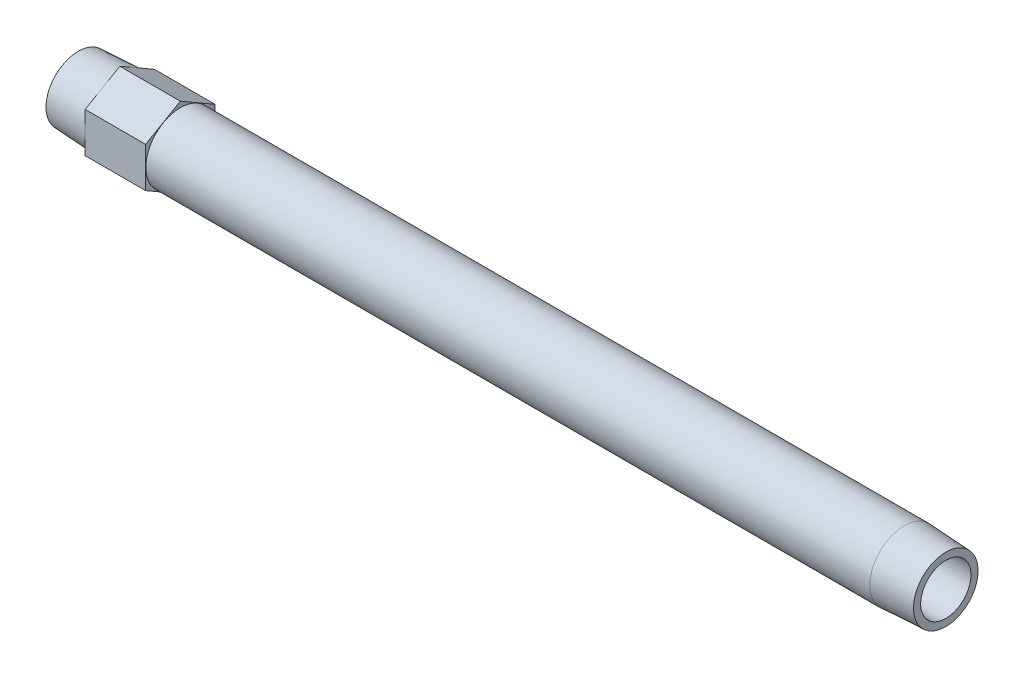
ISO-10303-21;
HEADER;
FILE_DESCRIPTION(('STEP AP214'),'2;1');
FILE_NAME('part.step','',(''),(''),'','','');
FILE_SCHEMA(('AUTOMOTIVE_DESIGN { 1 0 10303 214 1 1 1 1 }'));
ENDSEC;
DATA;
#1=APPLICATION_CONTEXT('core data for automotive mechanical design processes');
#2=APPLICATION_PROTOCOL_DEFINITION('international standard','automotive_design',2000,#1);
#3=PRODUCT_CONTEXT('',#1,'mechanical');
#4=PRODUCT('Part','Part','',(#3));
#5=PRODUCT_RELATED_PRODUCT_CATEGORY('part','',(#4));
#6=PRODUCT_DEFINITION_FORMATION('','',#4);
#7=PRODUCT_DEFINITION_CONTEXT('part definition',#1,'design');
#8=PRODUCT_DEFINITION('design','',#6,#7);
#9=PRODUCT_DEFINITION_SHAPE('','',#8);
#10=(LENGTH_UNIT() NAMED_UNIT(*) SI_UNIT(.MILLI.,.METRE.));
#11=(NAMED_UNIT(*) PLANE_ANGLE_UNIT() SI_UNIT($,.RADIAN.));
#12=(NAMED_UNIT(*) SI_UNIT($,.STERADIAN.) SOLID_ANGLE_UNIT());
#13=UNCERTAINTY_MEASURE_WITH_UNIT(LENGTH_MEASURE(1.E-05),#10,'distance_accuracy_value','');
#14=(GEOMETRIC_REPRESENTATION_CONTEXT(3) GLOBAL_UNCERTAINTY_ASSIGNED_CONTEXT((#13)) GLOBAL_UNIT_ASSIGNED_CONTEXT((#10,
#11,#12)) REPRESENTATION_CONTEXT('',''));
#15=CARTESIAN_POINT('',(0.,0.,0.));
#16=DIRECTION('',(0.,0.,1.));
#17=DIRECTION('',(1.,0.,0.));
#18=AXIS2_PLACEMENT_3D('',#15,#16,#17);
#19=CARTESIAN_POINT('',(0.,0.,-8.03071885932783));
#20=DIRECTION('',(1.,0.,0.));
#21=DIRECTION('',(0.,0.,-1.));
#22=AXIS2_PLACEMENT_3D('',#19,#20,#21);
#23=PLANE('',#22);
#24=CARTESIAN_POINT('',(0.,0.,0.));
#25=DIRECTION('',(-1.,0.,0.));
#26=DIRECTION('',(0.,0.,1.));
#27=AXIS2_PLACEMENT_3D('',#24,#25,#26);
#28=CIRCLE('',#27,8.03071885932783);
#29=CARTESIAN_POINT('',(0.,0.,8.03071885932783));
#30=VERTEX_POINT('',#29);
#31=EDGE_CURVE('E147',#30,#30,#28,.T.);
#32=ORIENTED_EDGE('',*,*,#31,.T.);
#33=EDGE_LOOP('',(#32));
#34=FACE_BOUND('',#33,.T.);
#35=CARTESIAN_POINT('',(0.,0.,0.));
#36=DIRECTION('',(1.,0.,0.));
#37=DIRECTION('',(0.,0.,1.));
#38=AXIS2_PLACEMENT_3D('',#35,#36,#37);
#39=CIRCLE('',#38,6.2611);
#40=CARTESIAN_POINT('',(0.,0.,6.2611));
#41=VERTEX_POINT('',#40);
#42=EDGE_CURVE('E159',#41,#41,#39,.T.);
#43=ORIENTED_EDGE('',*,*,#42,.T.);
#44=EDGE_LOOP('',(#43));
#45=FACE_BOUND('',#44,.T.);
#46=ADVANCED_FACE('F15',(#34,#45),#23,.F.);
#47=CARTESIAN_POINT('',(215.9,0.,-8.0307188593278));
#48=DIRECTION('',(-1.,0.,0.));
#49=DIRECTION('',(0.,0.,1.));
#50=AXIS2_PLACEMENT_3D('',#47,#48,#49);
#51=PLANE('',#50);
#52=CARTESIAN_POINT('',(215.9,0.,0.));
#53=DIRECTION('',(-1.,0.,0.));
#54=DIRECTION('',(0.,0.,1.));
#55=AXIS2_PLACEMENT_3D('',#52,#53,#54);
#56=CIRCLE('',#55,8.0307188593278);
#57=CARTESIAN_POINT('',(215.9,0.,8.0307188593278));
#58=VERTEX_POINT('',#57);
#59=EDGE_CURVE('E150',#58,#58,#56,.T.);
#60=ORIENTED_EDGE('',*,*,#59,.F.);
#61=EDGE_LOOP('',(#60));
#62=FACE_BOUND('',#61,.T.);
#63=CARTESIAN_POINT('',(215.9,0.,0.));
#64=DIRECTION('',(-1.,0.,0.));
#65=DIRECTION('',(0.,0.,1.));
#66=AXIS2_PLACEMENT_3D('',#63,#64,#65);
#67=CIRCLE('',#66,6.2611);
#68=CARTESIAN_POINT('',(215.9,0.,6.2611));
#69=VERTEX_POINT('',#68);
#70=EDGE_CURVE('E156',#69,#69,#67,.F.);
#71=ORIENTED_EDGE('',*,*,#70,.F.);
#72=EDGE_LOOP('',(#71));
#73=FACE_BOUND('',#72,.T.);
#74=ADVANCED_FACE('F178',(#62,#73),#51,.F.);
#75=CARTESIAN_POINT('',(25.4,-4.9859969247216,-8.636));
#76=DIRECTION('',(1.,0.,0.));
#77=DIRECTION('',(0.,1.,0.));
#78=AXIS2_PLACEMENT_3D('',#75,#76,#77);
#79=PLANE('',#78);
#80=DIRECTION('',(0.,0.5,-0.866025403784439));
#81=VECTOR('',#80,1.);
#82=CARTESIAN_POINT('',(25.4,-9.97199384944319,0.));
#83=LINE('',#82,#81);
#84=CARTESIAN_POINT('',(25.4,-9.97199384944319,0.));
#85=VERTEX_POINT('',#84);
#86=CARTESIAN_POINT('',(25.4,-4.9859969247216,-8.636));
#87=VERTEX_POINT('',#86);
#88=EDGE_CURVE('E103',#85,#87,#83,.T.);
#89=ORIENTED_EDGE('',*,*,#88,.T.);
#90=DIRECTION('',(0.,1.,0.));
#91=VECTOR('',#90,1.);
#92=CARTESIAN_POINT('',(25.4,-4.9859969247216,-8.636));
#93=LINE('',#92,#91);
#94=CARTESIAN_POINT('',(25.4,4.9859969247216,-8.636));
#95=VERTEX_POINT('',#94);
#96=EDGE_CURVE('E83',#87,#95,#93,.T.);
#97=ORIENTED_EDGE('',*,*,#96,.T.);
#98=DIRECTION('',(0.,0.5,0.866025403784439));
#99=VECTOR('',#98,1.);
#100=CARTESIAN_POINT('',(25.4,4.9859969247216,-8.636));
#101=LINE('',#100,#99);
#102=CARTESIAN_POINT('',(25.4,9.97199384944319,0.));
#103=VERTEX_POINT('',#102);
#104=EDGE_CURVE('E102',#95,#103,#101,.T.);
#105=ORIENTED_EDGE('',*,*,#104,.T.);
#106=DIRECTION('',(0.,-0.5,0.866025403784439));
#107=VECTOR('',#106,1.);
#108=CARTESIAN_POINT('',(25.4,9.97199384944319,0.));
#109=LINE('',#108,#107);
#110=CARTESIAN_POINT('',(25.4,4.9859969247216,8.636));
#111=VERTEX_POINT('',#110);
#112=EDGE_CURVE('E105',#103,#111,#109,.T.);
#113=ORIENTED_EDGE('',*,*,#112,.T.);
#114=DIRECTION('',(0.,-1.,0.));
#115=VECTOR('',#114,1.);
#116=CARTESIAN_POINT('',(25.4,4.9859969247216,8.636));
#117=LINE('',#116,#115);
#118=CARTESIAN_POINT('',(25.4,-4.9859969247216,8.636));
#119=VERTEX_POINT('',#118);
#120=EDGE_CURVE('E35',#111,#119,#117,.T.);
#121=ORIENTED_EDGE('',*,*,#120,.T.);
#122=DIRECTION('',(0.,-0.5,-0.866025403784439));
#123=VECTOR('',#122,1.);
#124=CARTESIAN_POINT('',(25.4,-4.9859969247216,8.636));
#125=LINE('',#124,#123);
#126=EDGE_CURVE('E30',#119,#85,#125,.T.);
#127=ORIENTED_EDGE('',*,*,#126,.T.);
#128=EDGE_LOOP('',(#89,#97,#105,#113,#121,#127));
#129=FACE_BOUND('',#128,.T.);
#130=CARTESIAN_POINT('',(25.4,0.,0.));
#131=DIRECTION('',(1.,0.,0.));
#132=DIRECTION('',(0.,1.,0.));
#133=AXIS2_PLACEMENT_3D('',#130,#131,#132);
#134=CIRCLE('',#133,8.5725);
#135=CARTESIAN_POINT('',(25.4,8.5725,0.));
#136=VERTEX_POINT('',#135);
#137=EDGE_CURVE('E89',#136,#136,#134,.F.);
#138=ORIENTED_EDGE('',*,*,#137,.T.);
#139=EDGE_LOOP('',(#138));
#140=FACE_BOUND('',#139,.T.);
#141=ADVANCED_FACE('F124',(#129,#140),#79,.T.);
#142=CARTESIAN_POINT('',(10.3378,-4.9859969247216,-8.636));
#143=DIRECTION('',(1.,0.,0.));
#144=DIRECTION('',(0.,1.,0.));
#145=AXIS2_PLACEMENT_3D('',#142,#143,#144);
#146=PLANE('',#145);
#147=DIRECTION('',(0.,0.5,-0.866025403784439));
#148=VECTOR('',#147,1.);
#149=CARTESIAN_POINT('',(10.3378,-9.97199384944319,0.));
#150=LINE('',#149,#148);
#151=CARTESIAN_POINT('',(10.3378,-9.97199384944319,0.));
#152=VERTEX_POINT('',#151);
#153=CARTESIAN_POINT('',(10.3378,-4.9859969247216,-8.636));
#154=VERTEX_POINT('',#153);
#155=EDGE_CURVE('E73',#152,#154,#150,.T.);
#156=ORIENTED_EDGE('',*,*,#155,.F.);
#157=DIRECTION('',(0.,-0.5,-0.866025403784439));
#158=VECTOR('',#157,1.);
#159=CARTESIAN_POINT('',(10.3378,-4.9859969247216,8.636));
#160=LINE('',#159,#158);
#161=CARTESIAN_POINT('',(10.3378,-4.9859969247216,8.636));
#162=VERTEX_POINT('',#161);
#163=EDGE_CURVE('E99',#162,#152,#160,.T.);
#164=ORIENTED_EDGE('',*,*,#163,.F.);
#165=DIRECTION('',(0.,-1.,0.));
#166=VECTOR('',#165,1.);
#167=CARTESIAN_POINT('',(10.3378,4.9859969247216,8.636));
#168=LINE('',#167,#166);
#169=CARTESIAN_POINT('',(10.3378,4.9859969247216,8.636));
#170=VERTEX_POINT('',#169);
#171=EDGE_CURVE('E133',#170,#162,#168,.T.);
#172=ORIENTED_EDGE('',*,*,#171,.F.);
#173=DIRECTION('',(0.,-0.5,0.866025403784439));
#174=VECTOR('',#173,1.);
#175=CARTESIAN_POINT('',(10.3378,9.97199384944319,0.));
#176=LINE('',#175,#174);
#177=CARTESIAN_POINT('',(10.3378,9.97199384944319,0.));
#178=VERTEX_POINT('',#177);
#179=EDGE_CURVE('E129',#178,#170,#176,.T.);
#180=ORIENTED_EDGE('',*,*,#179,.F.);
#181=DIRECTION('',(0.,0.5,0.866025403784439));
#182=VECTOR('',#181,1.);
#183=CARTESIAN_POINT('',(10.3378,4.9859969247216,-8.636));
#184=LINE('',#183,#182);
#185=CARTESIAN_POINT('',(10.3378,4.9859969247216,-8.636));
#186=VERTEX_POINT('',#185);
#187=EDGE_CURVE('E75',#186,#178,#184,.T.);
#188=ORIENTED_EDGE('',*,*,#187,.F.);
#189=DIRECTION('',(0.,1.,0.));
#190=VECTOR('',#189,1.);
#191=CARTESIAN_POINT('',(10.3378,-4.9859969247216,-8.636));
#192=LINE('',#191,#190);
#193=EDGE_CURVE('E68',#154,#186,#192,.T.);
#194=ORIENTED_EDGE('',*,*,#193,.F.);
#195=EDGE_LOOP('',(#156,#164,#172,#180,#188,#194));
#196=FACE_BOUND('',#195,.T.);
#197=CARTESIAN_POINT('',(10.3378,0.,0.));
#198=DIRECTION('',(-1.,0.,0.));
#199=DIRECTION('',(0.,0.,1.));
#200=AXIS2_PLACEMENT_3D('',#197,#198,#199);
#201=CIRCLE('',#200,8.5725);
#202=CARTESIAN_POINT('',(10.3378,0.,8.5725));
#203=VERTEX_POINT('',#202);
#204=EDGE_CURVE('E95',#203,#203,#201,.T.);
#205=ORIENTED_EDGE('',*,*,#204,.F.);
#206=EDGE_LOOP('',(#205));
#207=FACE_BOUND('',#206,.T.);
#208=ADVANCED_FACE('F69',(#196,#207),#146,.F.);
#209=CARTESIAN_POINT('',(25.4,-9.97199384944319,0.));
#210=DIRECTION('',(0.,0.866025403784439,0.5));
#211=DIRECTION('',(0.,-0.5,0.866025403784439));
#212=AXIS2_PLACEMENT_3D('',#209,#210,#211);
#213=PLANE('',#212);
#214=ORIENTED_EDGE('',*,*,#155,.T.);
#215=DIRECTION('',(-1.,0.,0.));
#216=VECTOR('',#215,1.);
#217=CARTESIAN_POINT('',(25.4,-4.9859969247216,-8.636));
#218=LINE('',#217,#216);
#219=EDGE_CURVE('E10',#87,#154,#218,.T.);
#220=ORIENTED_EDGE('',*,*,#219,.F.);
#221=ORIENTED_EDGE('',*,*,#88,.F.);
#222=DIRECTION('',(-1.,0.,0.));
#223=VECTOR('',#222,1.);
#224=CARTESIAN_POINT('',(25.4,-9.97199384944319,0.));
#225=LINE('',#224,#223);
#226=EDGE_CURVE('E87',#85,#152,#225,.T.);
#227=ORIENTED_EDGE('',*,*,#226,.T.);
#228=EDGE_LOOP('',(#214,#220,#221,#227));
#229=FACE_BOUND('',#228,.T.);
#230=ADVANCED_FACE('F17',(#229),#213,.F.);
#231=CARTESIAN_POINT('',(25.4,-4.9859969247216,-8.636));
#232=DIRECTION('',(0.,0.,1.));
#233=DIRECTION('',(1.,0.,0.));
#234=AXIS2_PLACEMENT_3D('',#231,#232,#233);
#235=PLANE('',#234);
#236=ORIENTED_EDGE('',*,*,#193,.T.);
#237=DIRECTION('',(-1.,0.,0.));
#238=VECTOR('',#237,1.);
#239=CARTESIAN_POINT('',(25.4,4.9859969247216,-8.636));
#240=LINE('',#239,#238);
#241=EDGE_CURVE('E23',#95,#186,#240,.T.);
#242=ORIENTED_EDGE('',*,*,#241,.F.);
#243=ORIENTED_EDGE('',*,*,#96,.F.);
#244=ORIENTED_EDGE('',*,*,#219,.T.);
#245=EDGE_LOOP('',(#236,#242,#243,#244));
#246=FACE_BOUND('',#245,.T.);
#247=ADVANCED_FACE('F82',(#246),#235,.F.);
#248=CARTESIAN_POINT('',(25.4,4.9859969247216,-8.636));
#249=DIRECTION('',(0.,-0.866025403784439,0.5));
#250=DIRECTION('',(0.,-0.5,-0.866025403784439));
#251=AXIS2_PLACEMENT_3D('',#248,#249,#250);
#252=PLANE('',#251);
#253=ORIENTED_EDGE('',*,*,#187,.T.);
#254=DIRECTION('',(-1.,0.,0.));
#255=VECTOR('',#254,1.);
#256=CARTESIAN_POINT('',(25.4,9.97199384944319,0.));
#257=LINE('',#256,#255);
#258=EDGE_CURVE('E117',#103,#178,#257,.T.);
#259=ORIENTED_EDGE('',*,*,#258,.F.);
#260=ORIENTED_EDGE('',*,*,#104,.F.);
#261=ORIENTED_EDGE('',*,*,#241,.T.);
#262=EDGE_LOOP('',(#253,#259,#260,#261));
#263=FACE_BOUND('',#262,.T.);
#264=ADVANCED_FACE('F121',(#263),#252,.F.);
#265=CARTESIAN_POINT('',(25.4,9.97199384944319,0.));
#266=DIRECTION('',(0.,-0.866025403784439,-0.5));
#267=DIRECTION('',(0.,0.5,-0.866025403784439));
#268=AXIS2_PLACEMENT_3D('',#265,#266,#267);
#269=PLANE('',#268);
#270=ORIENTED_EDGE('',*,*,#179,.T.);
#271=DIRECTION('',(-1.,0.,0.));
#272=VECTOR('',#271,1.);
#273=CARTESIAN_POINT('',(25.4,4.9859969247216,8.636));
#274=LINE('',#273,#272);
#275=EDGE_CURVE('E114',#111,#170,#274,.T.);
#276=ORIENTED_EDGE('',*,*,#275,.F.);
#277=ORIENTED_EDGE('',*,*,#112,.F.);
#278=ORIENTED_EDGE('',*,*,#258,.T.);
#279=EDGE_LOOP('',(#270,#276,#277,#278));
#280=FACE_BOUND('',#279,.T.);
#281=ADVANCED_FACE('F128',(#280),#269,.F.);
#282=CARTESIAN_POINT('',(25.4,4.9859969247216,8.636));
#283=DIRECTION('',(0.,0.,-1.));
#284=DIRECTION('',(-1.,0.,0.));
#285=AXIS2_PLACEMENT_3D('',#282,#283,#284);
#286=PLANE('',#285);
#287=ORIENTED_EDGE('',*,*,#171,.T.);
#288=DIRECTION('',(-1.,0.,0.));
#289=VECTOR('',#288,1.);
#290=CARTESIAN_POINT('',(25.4,-4.9859969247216,8.636));
#291=LINE('',#290,#289);
#292=EDGE_CURVE('E111',#119,#162,#291,.T.);
#293=ORIENTED_EDGE('',*,*,#292,.F.);
#294=ORIENTED_EDGE('',*,*,#120,.F.);
#295=ORIENTED_EDGE('',*,*,#275,.T.);
#296=EDGE_LOOP('',(#287,#293,#294,#295));
#297=FACE_BOUND('',#296,.T.);
#298=ADVANCED_FACE('F132',(#297),#286,.F.);
#299=CARTESIAN_POINT('',(25.4,-4.9859969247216,8.636));
#300=DIRECTION('',(0.,0.866025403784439,-0.5));
#301=DIRECTION('',(0.,0.5,0.866025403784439));
#302=AXIS2_PLACEMENT_3D('',#299,#300,#301);
#303=PLANE('',#302);
#304=ORIENTED_EDGE('',*,*,#163,.T.);
#305=ORIENTED_EDGE('',*,*,#226,.F.);
#306=ORIENTED_EDGE('',*,*,#126,.F.);
#307=ORIENTED_EDGE('',*,*,#292,.T.);
#308=EDGE_LOOP('',(#304,#305,#306,#307));
#309=FACE_BOUND('',#308,.T.);
#310=ADVANCED_FACE('F135',(#309),#303,.F.);
#311=CARTESIAN_POINT('',(10.3378,0.,0.));
#312=DIRECTION('',(1.,0.,0.));
#313=DIRECTION('',(0.,0.,-1.));
#314=AXIS2_PLACEMENT_3D('',#311,#312,#313);
#315=CONICAL_SURFACE('',#314,8.5725,0.0523598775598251);
#316=ORIENTED_EDGE('',*,*,#31,.F.);
#317=EDGE_LOOP('',(#316));
#318=FACE_BOUND('',#317,.T.);
#319=ORIENTED_EDGE('',*,*,#204,.T.);
#320=EDGE_LOOP('',(#319));
#321=FACE_BOUND('',#320,.T.);
#322=ADVANCED_FACE('F187',(#318,#321),#315,.T.);
#323=CARTESIAN_POINT('',(-60.,0.,0.));
#324=DIRECTION('',(-1.,0.,0.));
#325=DIRECTION('',(0.,0.,1.));
#326=AXIS2_PLACEMENT_3D('',#323,#324,#325);
#327=CYLINDRICAL_SURFACE('',#326,8.5725);
#328=ORIENTED_EDGE('',*,*,#137,.F.);
#329=EDGE_LOOP('',(#328));
#330=FACE_BOUND('',#329,.T.);
#331=CARTESIAN_POINT('',(205.5622,0.,0.));
#332=DIRECTION('',(-1.,0.,0.));
#333=DIRECTION('',(0.,0.,1.));
#334=AXIS2_PLACEMENT_3D('',#331,#332,#333);
#335=CIRCLE('',#334,8.5725);
#336=CARTESIAN_POINT('',(205.5622,0.,8.5725));
#337=VERTEX_POINT('',#336);
#338=EDGE_CURVE('E153',#337,#337,#335,.T.);
#339=ORIENTED_EDGE('',*,*,#338,.T.);
#340=EDGE_LOOP('',(#339));
#341=FACE_BOUND('',#340,.T.);
#342=ADVANCED_FACE('F174',(#330,#341),#327,.T.);
#343=CARTESIAN_POINT('',(215.9,0.,0.));
#344=DIRECTION('',(-1.,0.,0.));
#345=DIRECTION('',(0.,0.,1.));
#346=AXIS2_PLACEMENT_3D('',#343,#344,#345);
#347=CONICAL_SURFACE('',#346,8.0307188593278,0.0523598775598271);
#348=ORIENTED_EDGE('',*,*,#338,.F.);
#349=EDGE_LOOP('',(#348));
#350=FACE_BOUND('',#349,.T.);
#351=ORIENTED_EDGE('',*,*,#59,.T.);
#352=EDGE_LOOP('',(#351));
#353=FACE_BOUND('',#352,.T.);
#354=ADVANCED_FACE('F167',(#350,#353),#347,.T.);
#355=CARTESIAN_POINT('',(217.506079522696,0.,0.));
#356=DIRECTION('',(-1.,0.,0.));
#357=DIRECTION('',(0.,0.,1.));
#358=AXIS2_PLACEMENT_3D('',#355,#356,#357);
#359=CYLINDRICAL_SURFACE('',#358,6.2611);
#360=ORIENTED_EDGE('',*,*,#70,.T.);
#361=EDGE_LOOP('',(#360));
#362=FACE_BOUND('',#361,.T.);
#363=ORIENTED_EDGE('',*,*,#42,.F.);
#364=EDGE_LOOP('',(#363));
#365=FACE_BOUND('',#364,.T.);
#366=ADVANCED_FACE('F165',(#362,#365),#359,.F.);
#367=CLOSED_SHELL('',(#46,#74,#141,#208,#230,#247,#264,#281,#298,#310,#322,#342,#354,#366));
#368=MANIFOLD_SOLID_BREP('B1',#367);
#369=ADVANCED_BREP_SHAPE_REPRESENTATION('',(#18,#368),#14);
#370=SHAPE_DEFINITION_REPRESENTATION(#9,#369);
ENDSEC;
END-ISO-10303-21;
